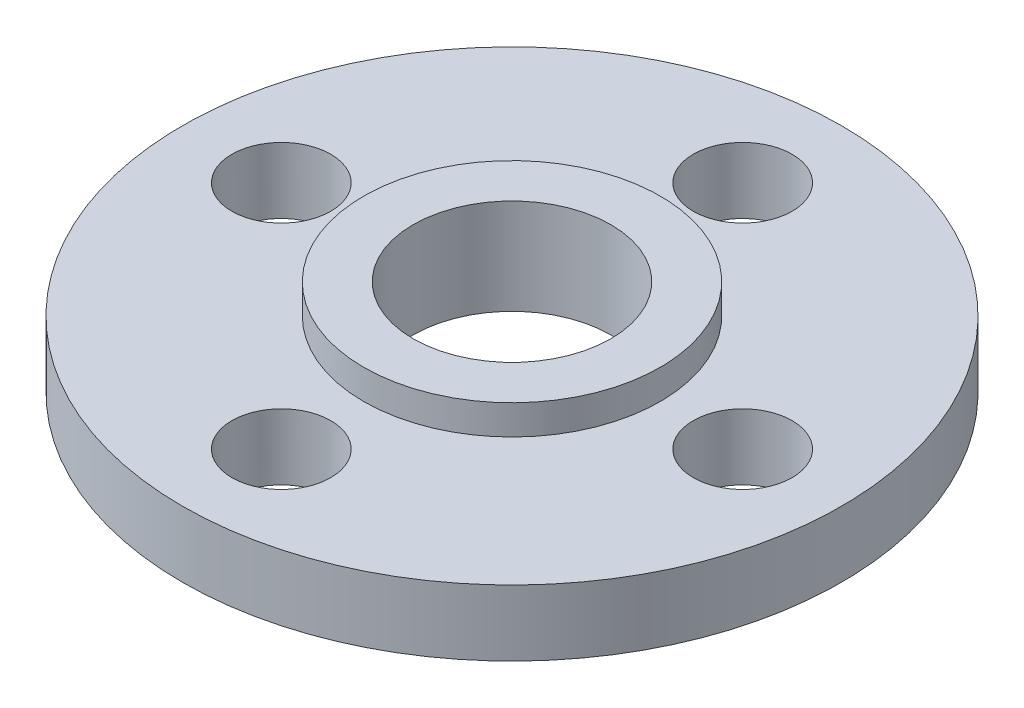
ISO-10303-21;
HEADER;
FILE_DESCRIPTION(('STEP AP214'),'2;1');
FILE_NAME('part.step','',(''),(''),'','','');
FILE_SCHEMA(('AUTOMOTIVE_DESIGN { 1 0 10303 214 1 1 1 1 }'));
ENDSEC;
DATA;
#1=APPLICATION_CONTEXT('core data for automotive mechanical design processes');
#2=APPLICATION_PROTOCOL_DEFINITION('international standard','automotive_design',2000,#1);
#3=PRODUCT_CONTEXT('',#1,'mechanical');
#4=PRODUCT('Part','Part','',(#3));
#5=PRODUCT_RELATED_PRODUCT_CATEGORY('part','',(#4));
#6=PRODUCT_DEFINITION_FORMATION('','',#4);
#7=PRODUCT_DEFINITION_CONTEXT('part definition',#1,'design');
#8=PRODUCT_DEFINITION('design','',#6,#7);
#9=PRODUCT_DEFINITION_SHAPE('','',#8);
#10=(LENGTH_UNIT() NAMED_UNIT(*) SI_UNIT(.MILLI.,.METRE.));
#11=(NAMED_UNIT(*) PLANE_ANGLE_UNIT() SI_UNIT($,.RADIAN.));
#12=(NAMED_UNIT(*) SI_UNIT($,.STERADIAN.) SOLID_ANGLE_UNIT());
#13=UNCERTAINTY_MEASURE_WITH_UNIT(LENGTH_MEASURE(1.E-05),#10,'distance_accuracy_value','');
#14=(GEOMETRIC_REPRESENTATION_CONTEXT(3) GLOBAL_UNCERTAINTY_ASSIGNED_CONTEXT((#13)) GLOBAL_UNIT_ASSIGNED_CONTEXT((#10,
#11,#12)) REPRESENTATION_CONTEXT('',''));
#15=CARTESIAN_POINT('',(0.,0.,0.));
#16=DIRECTION('',(0.,0.,1.));
#17=DIRECTION('',(1.,0.,0.));
#18=AXIS2_PLACEMENT_3D('',#15,#16,#17);
#19=CARTESIAN_POINT('',(0.,2.,0.));
#20=DIRECTION('',(0.,-1.,0.));
#21=DIRECTION('',(0.,0.,-1.));
#22=AXIS2_PLACEMENT_3D('',#19,#20,#21);
#23=CYLINDRICAL_SURFACE('',#22,10.);
#24=CARTESIAN_POINT('',(0.,2.,0.));
#25=DIRECTION('',(0.,1.,0.));
#26=DIRECTION('',(0.,0.,1.));
#27=AXIS2_PLACEMENT_3D('',#24,#25,#26);
#28=CIRCLE('',#27,10.);
#29=CARTESIAN_POINT('',(0.,2.,10.));
#30=VERTEX_POINT('',#29);
#31=EDGE_CURVE('E46',#30,#30,#28,.T.);
#32=ORIENTED_EDGE('',*,*,#31,.F.);
#33=EDGE_LOOP('',(#32));
#34=FACE_BOUND('',#33,.T.);
#35=CARTESIAN_POINT('',(0.,0.,0.));
#36=DIRECTION('',(0.,1.,0.));
#37=DIRECTION('',(0.,0.,1.));
#38=AXIS2_PLACEMENT_3D('',#35,#36,#37);
#39=CIRCLE('',#38,10.);
#40=CARTESIAN_POINT('',(0.,0.,10.));
#41=VERTEX_POINT('',#40);
#42=EDGE_CURVE('E51',#41,#41,#39,.T.);
#43=ORIENTED_EDGE('',*,*,#42,.T.);
#44=EDGE_LOOP('',(#43));
#45=FACE_BOUND('',#44,.T.);
#46=ADVANCED_FACE('F39',(#34,#45),#23,.T.);
#47=CARTESIAN_POINT('',(0.,2.,0.));
#48=DIRECTION('',(0.,1.,0.));
#49=DIRECTION('',(0.,0.,1.));
#50=AXIS2_PLACEMENT_3D('',#47,#48,#49);
#51=PLANE('',#50);
#52=CARTESIAN_POINT('',(0.,2.,7.));
#53=DIRECTION('',(0.,1.,0.));
#54=DIRECTION('',(0.,0.,1.));
#55=AXIS2_PLACEMENT_3D('',#52,#53,#54);
#56=CIRCLE('',#55,1.5);
#57=CARTESIAN_POINT('',(0.,2.,8.5));
#58=VERTEX_POINT('',#57);
#59=EDGE_CURVE('E60',#58,#58,#56,.T.);
#60=ORIENTED_EDGE('',*,*,#59,.F.);
#61=EDGE_LOOP('',(#60));
#62=FACE_BOUND('',#61,.T.);
#63=CARTESIAN_POINT('',(7.,2.,0.));
#64=DIRECTION('',(0.,1.,0.));
#65=DIRECTION('',(0.,0.,1.));
#66=AXIS2_PLACEMENT_3D('',#63,#64,#65);
#67=CIRCLE('',#66,1.5);
#68=CARTESIAN_POINT('',(7.,2.,1.49999999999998));
#69=VERTEX_POINT('',#68);
#70=EDGE_CURVE('E64',#69,#69,#67,.T.);
#71=ORIENTED_EDGE('',*,*,#70,.F.);
#72=EDGE_LOOP('',(#71));
#73=FACE_BOUND('',#72,.T.);
#74=CARTESIAN_POINT('',(0.,2.,-7.));
#75=DIRECTION('',(0.,1.,0.));
#76=DIRECTION('',(0.,0.,1.));
#77=AXIS2_PLACEMENT_3D('',#74,#75,#76);
#78=CIRCLE('',#77,1.5);
#79=CARTESIAN_POINT('',(0.,2.,-5.5));
#80=VERTEX_POINT('',#79);
#81=EDGE_CURVE('E68',#80,#80,#78,.T.);
#82=ORIENTED_EDGE('',*,*,#81,.F.);
#83=EDGE_LOOP('',(#82));
#84=FACE_BOUND('',#83,.T.);
#85=CARTESIAN_POINT('',(-7.,2.,0.));
#86=DIRECTION('',(0.,1.,0.));
#87=DIRECTION('',(0.,0.,1.));
#88=AXIS2_PLACEMENT_3D('',#85,#86,#87);
#89=CIRCLE('',#88,1.5);
#90=CARTESIAN_POINT('',(-7.,2.,1.50000000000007));
#91=VERTEX_POINT('',#90);
#92=EDGE_CURVE('E73',#91,#91,#89,.T.);
#93=ORIENTED_EDGE('',*,*,#92,.F.);
#94=EDGE_LOOP('',(#93));
#95=FACE_BOUND('',#94,.T.);
#96=CARTESIAN_POINT('',(0.,2.,0.));
#97=DIRECTION('',(0.,1.,0.));
#98=DIRECTION('',(0.,0.,1.));
#99=AXIS2_PLACEMENT_3D('',#96,#97,#98);
#100=CIRCLE('',#99,4.5);
#101=CARTESIAN_POINT('',(0.,2.,4.5));
#102=VERTEX_POINT('',#101);
#103=EDGE_CURVE('E10',#102,#102,#100,.T.);
#104=ORIENTED_EDGE('',*,*,#103,.F.);
#105=EDGE_LOOP('',(#104));
#106=FACE_BOUND('',#105,.T.);
#107=ORIENTED_EDGE('',*,*,#31,.T.);
#108=EDGE_LOOP('',(#107));
#109=FACE_BOUND('',#108,.T.);
#110=ADVANCED_FACE('F98',(#62,#73,#84,#95,#106,#109),#51,.T.);
#111=CARTESIAN_POINT('',(0.,0.,0.));
#112=DIRECTION('',(0.,1.,0.));
#113=DIRECTION('',(0.,0.,1.));
#114=AXIS2_PLACEMENT_3D('',#111,#112,#113);
#115=PLANE('',#114);
#116=CARTESIAN_POINT('',(0.,0.,7.));
#117=DIRECTION('',(0.,-1.,0.));
#118=DIRECTION('',(0.,0.,-1.));
#119=AXIS2_PLACEMENT_3D('',#116,#117,#118);
#120=CIRCLE('',#119,1.5);
#121=CARTESIAN_POINT('',(0.,0.,5.5));
#122=VERTEX_POINT('',#121);
#123=EDGE_CURVE('E79',#122,#122,#120,.T.);
#124=ORIENTED_EDGE('',*,*,#123,.F.);
#125=EDGE_LOOP('',(#124));
#126=FACE_BOUND('',#125,.T.);
#127=CARTESIAN_POINT('',(7.,0.,0.));
#128=DIRECTION('',(0.,-1.,0.));
#129=DIRECTION('',(0.,0.,-1.));
#130=AXIS2_PLACEMENT_3D('',#127,#128,#129);
#131=CIRCLE('',#130,1.5);
#132=CARTESIAN_POINT('',(7.,0.,-1.50000000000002));
#133=VERTEX_POINT('',#132);
#134=EDGE_CURVE('E80',#133,#133,#131,.T.);
#135=ORIENTED_EDGE('',*,*,#134,.F.);
#136=EDGE_LOOP('',(#135));
#137=FACE_BOUND('',#136,.T.);
#138=CARTESIAN_POINT('',(0.,0.,-7.));
#139=DIRECTION('',(0.,-1.,0.));
#140=DIRECTION('',(0.,0.,-1.));
#141=AXIS2_PLACEMENT_3D('',#138,#139,#140);
#142=CIRCLE('',#141,1.5);
#143=CARTESIAN_POINT('',(0.,0.,-8.5));
#144=VERTEX_POINT('',#143);
#145=EDGE_CURVE('E83',#144,#144,#142,.T.);
#146=ORIENTED_EDGE('',*,*,#145,.F.);
#147=EDGE_LOOP('',(#146));
#148=FACE_BOUND('',#147,.T.);
#149=CARTESIAN_POINT('',(-7.,0.,0.));
#150=DIRECTION('',(0.,-1.,0.));
#151=DIRECTION('',(0.,0.,-1.));
#152=AXIS2_PLACEMENT_3D('',#149,#150,#151);
#153=CIRCLE('',#152,1.5);
#154=CARTESIAN_POINT('',(-7.,0.,-1.49999999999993));
#155=VERTEX_POINT('',#154);
#156=EDGE_CURVE('E86',#155,#155,#153,.T.);
#157=ORIENTED_EDGE('',*,*,#156,.F.);
#158=EDGE_LOOP('',(#157));
#159=FACE_BOUND('',#158,.T.);
#160=CARTESIAN_POINT('',(0.,0.,0.));
#161=DIRECTION('',(0.,-1.,0.));
#162=DIRECTION('',(0.,0.,-1.));
#163=AXIS2_PLACEMENT_3D('',#160,#161,#162);
#164=CIRCLE('',#163,3.);
#165=CARTESIAN_POINT('',(0.,0.,-3.));
#166=VERTEX_POINT('',#165);
#167=EDGE_CURVE('E76',#166,#166,#164,.T.);
#168=ORIENTED_EDGE('',*,*,#167,.F.);
#169=EDGE_LOOP('',(#168));
#170=FACE_BOUND('',#169,.T.);
#171=ORIENTED_EDGE('',*,*,#42,.F.);
#172=EDGE_LOOP('',(#171));
#173=FACE_BOUND('',#172,.T.);
#174=ADVANCED_FACE('F94',(#126,#137,#148,#159,#170,#173),#115,.F.);
#175=CARTESIAN_POINT('',(0.,2.9,0.));
#176=DIRECTION('',(0.,-1.,0.));
#177=DIRECTION('',(0.,0.,-1.));
#178=AXIS2_PLACEMENT_3D('',#175,#176,#177);
#179=CYLINDRICAL_SURFACE('',#178,4.5);
#180=CARTESIAN_POINT('',(0.,2.9,0.));
#181=DIRECTION('',(0.,1.,0.));
#182=DIRECTION('',(0.,0.,1.));
#183=AXIS2_PLACEMENT_3D('',#180,#181,#182);
#184=CIRCLE('',#183,4.5);
#185=CARTESIAN_POINT('',(0.,2.9,4.5));
#186=VERTEX_POINT('',#185);
#187=EDGE_CURVE('E54',#186,#186,#184,.T.);
#188=ORIENTED_EDGE('',*,*,#187,.F.);
#189=EDGE_LOOP('',(#188));
#190=FACE_BOUND('',#189,.T.);
#191=ORIENTED_EDGE('',*,*,#103,.T.);
#192=EDGE_LOOP('',(#191));
#193=FACE_BOUND('',#192,.T.);
#194=ADVANCED_FACE('F97',(#190,#193),#179,.T.);
#195=CARTESIAN_POINT('',(0.,2.9,0.));
#196=DIRECTION('',(0.,1.,0.));
#197=DIRECTION('',(0.,0.,1.));
#198=AXIS2_PLACEMENT_3D('',#195,#196,#197);
#199=PLANE('',#198);
#200=CARTESIAN_POINT('',(0.,2.9,0.));
#201=DIRECTION('',(0.,1.,0.));
#202=DIRECTION('',(0.,0.,1.));
#203=AXIS2_PLACEMENT_3D('',#200,#201,#202);
#204=CIRCLE('',#203,3.);
#205=CARTESIAN_POINT('',(0.,2.9,3.));
#206=VERTEX_POINT('',#205);
#207=EDGE_CURVE('E42',#206,#206,#204,.T.);
#208=ORIENTED_EDGE('',*,*,#207,.F.);
#209=EDGE_LOOP('',(#208));
#210=FACE_BOUND('',#209,.T.);
#211=ORIENTED_EDGE('',*,*,#187,.T.);
#212=EDGE_LOOP('',(#211));
#213=FACE_BOUND('',#212,.T.);
#214=ADVANCED_FACE('F108',(#210,#213),#199,.T.);
#215=CARTESIAN_POINT('',(0.,3.9,0.));
#216=DIRECTION('',(0.,-1.,0.));
#217=DIRECTION('',(0.,0.,-1.));
#218=AXIS2_PLACEMENT_3D('',#215,#216,#217);
#219=CYLINDRICAL_SURFACE('',#218,3.);
#220=ORIENTED_EDGE('',*,*,#207,.T.);
#221=EDGE_LOOP('',(#220));
#222=FACE_BOUND('',#221,.T.);
#223=ORIENTED_EDGE('',*,*,#167,.T.);
#224=EDGE_LOOP('',(#223));
#225=FACE_BOUND('',#224,.T.);
#226=ADVANCED_FACE('F105',(#222,#225),#219,.F.);
#227=CARTESIAN_POINT('',(-7.,3.9,0.));
#228=DIRECTION('',(0.,-1.,0.));
#229=DIRECTION('',(0.,0.,-1.));
#230=AXIS2_PLACEMENT_3D('',#227,#228,#229);
#231=CYLINDRICAL_SURFACE('',#230,1.5);
#232=ORIENTED_EDGE('',*,*,#92,.T.);
#233=EDGE_LOOP('',(#232));
#234=FACE_BOUND('',#233,.T.);
#235=ORIENTED_EDGE('',*,*,#156,.T.);
#236=EDGE_LOOP('',(#235));
#237=FACE_BOUND('',#236,.T.);
#238=ADVANCED_FACE('F107',(#234,#237),#231,.F.);
#239=CARTESIAN_POINT('',(0.,3.9,-7.));
#240=DIRECTION('',(0.,-1.,0.));
#241=DIRECTION('',(0.,0.,-1.));
#242=AXIS2_PLACEMENT_3D('',#239,#240,#241);
#243=CYLINDRICAL_SURFACE('',#242,1.5);
#244=ORIENTED_EDGE('',*,*,#81,.T.);
#245=EDGE_LOOP('',(#244));
#246=FACE_BOUND('',#245,.T.);
#247=ORIENTED_EDGE('',*,*,#145,.T.);
#248=EDGE_LOOP('',(#247));
#249=FACE_BOUND('',#248,.T.);
#250=ADVANCED_FACE('F92',(#246,#249),#243,.F.);
#251=CARTESIAN_POINT('',(7.,3.9,0.));
#252=DIRECTION('',(0.,-1.,0.));
#253=DIRECTION('',(0.,0.,-1.));
#254=AXIS2_PLACEMENT_3D('',#251,#252,#253);
#255=CYLINDRICAL_SURFACE('',#254,1.5);
#256=ORIENTED_EDGE('',*,*,#70,.T.);
#257=EDGE_LOOP('',(#256));
#258=FACE_BOUND('',#257,.T.);
#259=ORIENTED_EDGE('',*,*,#134,.T.);
#260=EDGE_LOOP('',(#259));
#261=FACE_BOUND('',#260,.T.);
#262=ADVANCED_FACE('F168',(#258,#261),#255,.F.);
#263=CARTESIAN_POINT('',(0.,3.9,7.));
#264=DIRECTION('',(0.,-1.,0.));
#265=DIRECTION('',(0.,0.,-1.));
#266=AXIS2_PLACEMENT_3D('',#263,#264,#265);
#267=CYLINDRICAL_SURFACE('',#266,1.5);
#268=ORIENTED_EDGE('',*,*,#59,.T.);
#269=EDGE_LOOP('',(#268));
#270=FACE_BOUND('',#269,.T.);
#271=ORIENTED_EDGE('',*,*,#123,.T.);
#272=EDGE_LOOP('',(#271));
#273=FACE_BOUND('',#272,.T.);
#274=ADVANCED_FACE('F178',(#270,#273),#267,.F.);
#275=CLOSED_SHELL('',(#46,#110,#174,#194,#214,#226,#238,#250,#262,#274));
#276=MANIFOLD_SOLID_BREP('B2',#275);
#277=ADVANCED_BREP_SHAPE_REPRESENTATION('',(#18,#276),#14);
#278=SHAPE_DEFINITION_REPRESENTATION(#9,#277);
ENDSEC;
END-ISO-10303-21;
